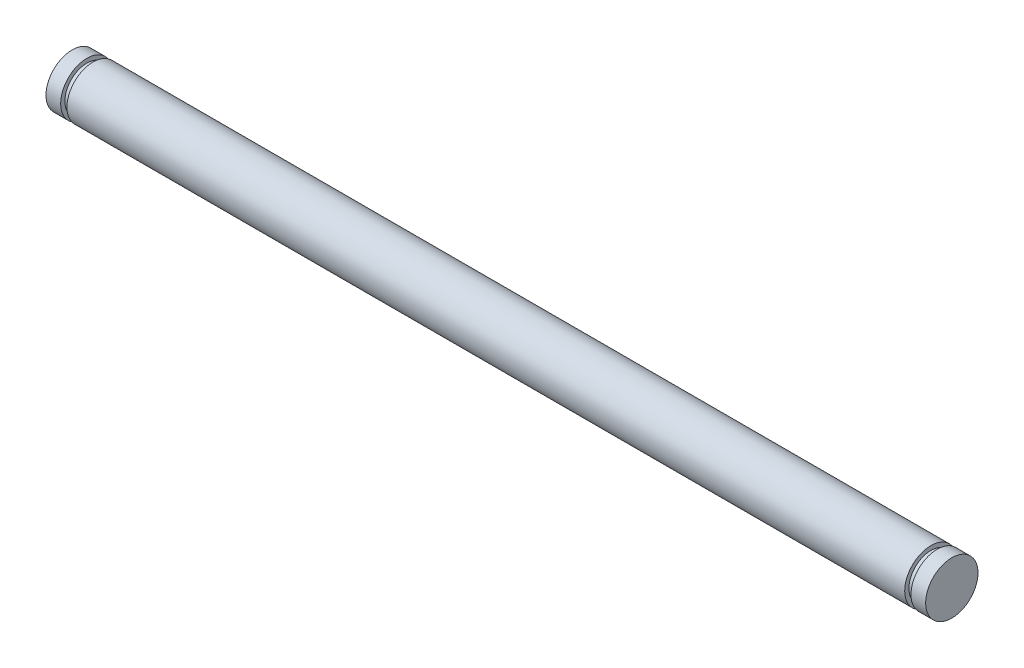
ISO-10303-21;
HEADER;
FILE_DESCRIPTION(('STEP AP214'),'2;1');
FILE_NAME('part.step','',(''),(''),'','','');
FILE_SCHEMA(('AUTOMOTIVE_DESIGN { 1 0 10303 214 1 1 1 1 }'));
ENDSEC;
DATA;
#1=APPLICATION_CONTEXT('core data for automotive mechanical design processes');
#2=APPLICATION_PROTOCOL_DEFINITION('international standard','automotive_design',2000,#1);
#3=PRODUCT_CONTEXT('',#1,'mechanical');
#4=PRODUCT('Part','Part','',(#3));
#5=PRODUCT_RELATED_PRODUCT_CATEGORY('part','',(#4));
#6=PRODUCT_DEFINITION_FORMATION('','',#4);
#7=PRODUCT_DEFINITION_CONTEXT('part definition',#1,'design');
#8=PRODUCT_DEFINITION('design','',#6,#7);
#9=PRODUCT_DEFINITION_SHAPE('','',#8);
#10=(LENGTH_UNIT() NAMED_UNIT(*) SI_UNIT(.MILLI.,.METRE.));
#11=(NAMED_UNIT(*) PLANE_ANGLE_UNIT() SI_UNIT($,.RADIAN.));
#12=(NAMED_UNIT(*) SI_UNIT($,.STERADIAN.) SOLID_ANGLE_UNIT());
#13=UNCERTAINTY_MEASURE_WITH_UNIT(LENGTH_MEASURE(1.E-05),#10,'distance_accuracy_value','');
#14=(GEOMETRIC_REPRESENTATION_CONTEXT(3) GLOBAL_UNCERTAINTY_ASSIGNED_CONTEXT((#13)) GLOBAL_UNIT_ASSIGNED_CONTEXT((#10,
#11,#12)) REPRESENTATION_CONTEXT('',''));
#15=CARTESIAN_POINT('',(0.,0.,0.));
#16=DIRECTION('',(0.,0.,1.));
#17=DIRECTION('',(1.,0.,0.));
#18=AXIS2_PLACEMENT_3D('',#15,#16,#17);
#19=CARTESIAN_POINT('',(53.34,0.,0.));
#20=DIRECTION('',(-1.,0.,0.));
#21=DIRECTION('',(0.,0.,1.));
#22=AXIS2_PLACEMENT_3D('',#19,#20,#21);
#23=CYLINDRICAL_SURFACE('',#22,3.175);
#24=CARTESIAN_POINT('',(-53.34,0.,0.));
#25=DIRECTION('',(1.,0.,0.));
#26=DIRECTION('',(0.,0.,-1.));
#27=AXIS2_PLACEMENT_3D('',#24,#25,#26);
#28=CIRCLE('',#27,3.175);
#29=CARTESIAN_POINT('',(-53.34,0.,-3.175));
#30=VERTEX_POINT('',#29);
#31=EDGE_CURVE('E38',#30,#30,#28,.T.);
#32=ORIENTED_EDGE('',*,*,#31,.T.);
#33=EDGE_LOOP('',(#32));
#34=FACE_BOUND('',#33,.T.);
#35=CARTESIAN_POINT('',(-51.562,0.,0.));
#36=DIRECTION('',(-1.,0.,0.));
#37=DIRECTION('',(0.,0.,1.));
#38=AXIS2_PLACEMENT_3D('',#35,#36,#37);
#39=CIRCLE('',#38,3.175);
#40=CARTESIAN_POINT('',(-51.562,0.,3.175));
#41=VERTEX_POINT('',#40);
#42=EDGE_CURVE('E50',#41,#41,#39,.T.);
#43=ORIENTED_EDGE('',*,*,#42,.T.);
#44=EDGE_LOOP('',(#43));
#45=FACE_BOUND('',#44,.T.);
#46=ADVANCED_FACE('F35',(#34,#45),#23,.T.);
#47=CARTESIAN_POINT('',(-53.34,0.,0.));
#48=DIRECTION('',(1.,0.,0.));
#49=DIRECTION('',(0.,0.,-1.));
#50=AXIS2_PLACEMENT_3D('',#47,#48,#49);
#51=PLANE('',#50);
#52=ORIENTED_EDGE('',*,*,#31,.F.);
#53=EDGE_LOOP('',(#52));
#54=FACE_BOUND('',#53,.T.);
#55=ADVANCED_FACE('F75',(#54),#51,.F.);
#56=CARTESIAN_POINT('',(-51.562,0.,-3.175));
#57=DIRECTION('',(1.,0.,0.));
#58=DIRECTION('',(0.,0.,-1.));
#59=AXIS2_PLACEMENT_3D('',#56,#57,#58);
#60=PLANE('',#59);
#61=CARTESIAN_POINT('',(-51.562,0.,0.));
#62=DIRECTION('',(-1.,0.,0.));
#63=DIRECTION('',(0.,0.,1.));
#64=AXIS2_PLACEMENT_3D('',#61,#62,#63);
#65=CIRCLE('',#64,2.667);
#66=CARTESIAN_POINT('',(-51.562,0.,2.667));
#67=VERTEX_POINT('',#66);
#68=EDGE_CURVE('E45',#67,#67,#65,.T.);
#69=ORIENTED_EDGE('',*,*,#68,.T.);
#70=EDGE_LOOP('',(#69));
#71=FACE_BOUND('',#70,.T.);
#72=ORIENTED_EDGE('',*,*,#42,.F.);
#73=EDGE_LOOP('',(#72));
#74=FACE_BOUND('',#73,.T.);
#75=ADVANCED_FACE('F72',(#71,#74),#60,.T.);
#76=CARTESIAN_POINT('',(-53.34,0.,0.));
#77=DIRECTION('',(-1.,0.,0.));
#78=DIRECTION('',(0.,0.,1.));
#79=AXIS2_PLACEMENT_3D('',#76,#77,#78);
#80=CYLINDRICAL_SURFACE('',#79,2.667);
#81=CARTESIAN_POINT('',(-50.8,0.,0.));
#82=DIRECTION('',(-1.,0.,0.));
#83=DIRECTION('',(0.,0.,1.));
#84=AXIS2_PLACEMENT_3D('',#81,#82,#83);
#85=CIRCLE('',#84,2.667);
#86=CARTESIAN_POINT('',(-50.8,0.,2.667));
#87=VERTEX_POINT('',#86);
#88=EDGE_CURVE('E62',#87,#87,#85,.T.);
#89=ORIENTED_EDGE('',*,*,#88,.T.);
#90=EDGE_LOOP('',(#89));
#91=FACE_BOUND('',#90,.T.);
#92=ORIENTED_EDGE('',*,*,#68,.F.);
#93=EDGE_LOOP('',(#92));
#94=FACE_BOUND('',#93,.T.);
#95=ADVANCED_FACE('F74',(#91,#94),#80,.T.);
#96=CARTESIAN_POINT('',(-50.8,0.,-3.175));
#97=DIRECTION('',(-1.,0.,0.));
#98=DIRECTION('',(0.,0.,1.));
#99=AXIS2_PLACEMENT_3D('',#96,#97,#98);
#100=PLANE('',#99);
#101=CARTESIAN_POINT('',(-50.8,0.,0.));
#102=DIRECTION('',(-1.,0.,0.));
#103=DIRECTION('',(0.,0.,1.));
#104=AXIS2_PLACEMENT_3D('',#101,#102,#103);
#105=CIRCLE('',#104,3.175);
#106=CARTESIAN_POINT('',(-50.8,0.,3.175));
#107=VERTEX_POINT('',#106);
#108=EDGE_CURVE('E65',#107,#107,#105,.T.);
#109=ORIENTED_EDGE('',*,*,#108,.T.);
#110=EDGE_LOOP('',(#109));
#111=FACE_BOUND('',#110,.T.);
#112=ORIENTED_EDGE('',*,*,#88,.F.);
#113=EDGE_LOOP('',(#112));
#114=FACE_BOUND('',#113,.T.);
#115=ADVANCED_FACE('F82',(#111,#114),#100,.T.);
#116=CARTESIAN_POINT('',(50.8,0.,0.));
#117=DIRECTION('',(-1.,0.,0.));
#118=DIRECTION('',(0.,0.,1.));
#119=AXIS2_PLACEMENT_3D('',#116,#117,#118);
#120=CIRCLE('',#119,3.175);
#121=CARTESIAN_POINT('',(50.8,0.,3.175));
#122=VERTEX_POINT('',#121);
#123=EDGE_CURVE('E47',#122,#122,#120,.T.);
#124=ORIENTED_EDGE('',*,*,#123,.T.);
#125=EDGE_LOOP('',(#124));
#126=FACE_BOUND('',#125,.T.);
#127=ORIENTED_EDGE('',*,*,#108,.F.);
#128=EDGE_LOOP('',(#127));
#129=FACE_BOUND('',#128,.T.);
#130=ADVANCED_FACE('F89',(#126,#129),#23,.T.);
#131=CARTESIAN_POINT('',(50.8,0.,-3.175));
#132=DIRECTION('',(1.,0.,0.));
#133=DIRECTION('',(0.,0.,-1.));
#134=AXIS2_PLACEMENT_3D('',#131,#132,#133);
#135=PLANE('',#134);
#136=CARTESIAN_POINT('',(50.8,0.,0.));
#137=DIRECTION('',(-1.,0.,0.));
#138=DIRECTION('',(0.,0.,1.));
#139=AXIS2_PLACEMENT_3D('',#136,#137,#138);
#140=CIRCLE('',#139,2.667);
#141=CARTESIAN_POINT('',(50.8,0.,2.667));
#142=VERTEX_POINT('',#141);
#143=EDGE_CURVE('E51',#142,#142,#140,.T.);
#144=ORIENTED_EDGE('',*,*,#143,.T.);
#145=EDGE_LOOP('',(#144));
#146=FACE_BOUND('',#145,.T.);
#147=ORIENTED_EDGE('',*,*,#123,.F.);
#148=EDGE_LOOP('',(#147));
#149=FACE_BOUND('',#148,.T.);
#150=ADVANCED_FACE('F94',(#146,#149),#135,.T.);
#151=CARTESIAN_POINT('',(-53.34,0.,0.));
#152=DIRECTION('',(-1.,0.,0.));
#153=DIRECTION('',(0.,0.,1.));
#154=AXIS2_PLACEMENT_3D('',#151,#152,#153);
#155=CYLINDRICAL_SURFACE('',#154,2.667);
#156=CARTESIAN_POINT('',(51.562,0.,0.));
#157=DIRECTION('',(-1.,0.,0.));
#158=DIRECTION('',(0.,0.,1.));
#159=AXIS2_PLACEMENT_3D('',#156,#157,#158);
#160=CIRCLE('',#159,2.667);
#161=CARTESIAN_POINT('',(51.562,0.,2.667));
#162=VERTEX_POINT('',#161);
#163=EDGE_CURVE('E54',#162,#162,#160,.T.);
#164=ORIENTED_EDGE('',*,*,#163,.T.);
#165=EDGE_LOOP('',(#164));
#166=FACE_BOUND('',#165,.T.);
#167=ORIENTED_EDGE('',*,*,#143,.F.);
#168=EDGE_LOOP('',(#167));
#169=FACE_BOUND('',#168,.T.);
#170=ADVANCED_FACE('F109',(#166,#169),#155,.T.);
#171=CARTESIAN_POINT('',(51.562,0.,-3.175));
#172=DIRECTION('',(-1.,0.,0.));
#173=DIRECTION('',(0.,0.,1.));
#174=AXIS2_PLACEMENT_3D('',#171,#172,#173);
#175=PLANE('',#174);
#176=CARTESIAN_POINT('',(51.562,0.,0.));
#177=DIRECTION('',(-1.,0.,0.));
#178=DIRECTION('',(0.,0.,1.));
#179=AXIS2_PLACEMENT_3D('',#176,#177,#178);
#180=CIRCLE('',#179,3.175);
#181=CARTESIAN_POINT('',(51.562,0.,3.175));
#182=VERTEX_POINT('',#181);
#183=EDGE_CURVE('E57',#182,#182,#180,.T.);
#184=ORIENTED_EDGE('',*,*,#183,.T.);
#185=EDGE_LOOP('',(#184));
#186=FACE_BOUND('',#185,.T.);
#187=ORIENTED_EDGE('',*,*,#163,.F.);
#188=EDGE_LOOP('',(#187));
#189=FACE_BOUND('',#188,.T.);
#190=ADVANCED_FACE('F102',(#186,#189),#175,.T.);
#191=CARTESIAN_POINT('',(53.34,0.,0.));
#192=DIRECTION('',(1.,0.,0.));
#193=DIRECTION('',(0.,0.,-1.));
#194=AXIS2_PLACEMENT_3D('',#191,#192,#193);
#195=PLANE('',#194);
#196=CARTESIAN_POINT('',(53.34,0.,0.));
#197=DIRECTION('',(1.,0.,0.));
#198=DIRECTION('',(0.,0.,-1.));
#199=AXIS2_PLACEMENT_3D('',#196,#197,#198);
#200=CIRCLE('',#199,3.175);
#201=CARTESIAN_POINT('',(53.34,0.,-3.175));
#202=VERTEX_POINT('',#201);
#203=EDGE_CURVE('E10',#202,#202,#200,.T.);
#204=ORIENTED_EDGE('',*,*,#203,.T.);
#205=EDGE_LOOP('',(#204));
#206=FACE_BOUND('',#205,.T.);
#207=ADVANCED_FACE('F97',(#206),#195,.T.);
#208=ORIENTED_EDGE('',*,*,#203,.F.);
#209=EDGE_LOOP('',(#208));
#210=FACE_BOUND('',#209,.T.);
#211=ORIENTED_EDGE('',*,*,#183,.F.);
#212=EDGE_LOOP('',(#211));
#213=FACE_BOUND('',#212,.T.);
#214=ADVANCED_FACE('F90',(#210,#213),#23,.T.);
#215=CLOSED_SHELL('',(#46,#55,#75,#95,#115,#130,#150,#170,#190,#207,#214));
#216=MANIFOLD_SOLID_BREP('B2',#215);
#217=ADVANCED_BREP_SHAPE_REPRESENTATION('',(#18,#216),#14);
#218=SHAPE_DEFINITION_REPRESENTATION(#9,#217);
ENDSEC;
END-ISO-10303-21;
